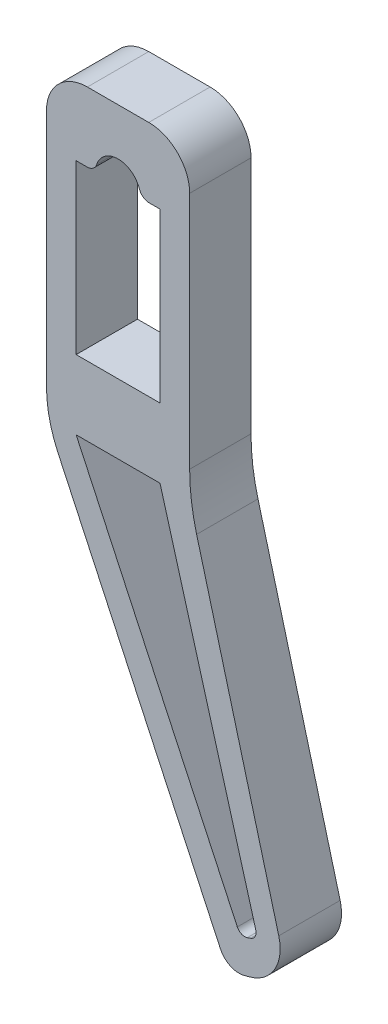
from build123d import *

# Parameters (mm, degrees)
SKETCH4_W           = 35
SKETCH4_H           = 75
BOSS_EXTRUDE2_DEPTH = 15
BOSS_EXTRUDE3_DEPTH = 15
SKETCH7_W           = 20.5
SKETCH7_H           = 41.05
CUT_EXTRUDE2_DEPTH  = 140.766205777
CUT_EXTRUDE4_DEPTH  = 140.766205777
CUT_EXTRUDE5_DEPTH  = 140.766205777
CUT_EXTRUDE6_DEPTH  = 140.766205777
FILLET1_R           = 10
FILLET2_R           = 5
FILLET3_R           = 30
FILLET4_R           = 50
FILLET6_R           = 2
FILLET5_R           = 10
FILLET7_R           = 2.5


with BuildPart() as part:
    # Sketch4 → Boss-Extrude2 (new body)
    with BuildSketch(Plane.XY):
        Rectangle(SKETCH4_W, SKETCH4_H)
    extrude(amount=BOSS_EXTRUDE2_DEPTH)

    # Sketch5 → Boss-Extrude3 (add)
    with BuildSketch(Plane.XY.offset(15)):
        Polygon((-17.5, -37.5), (26.799227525, -132.5), (41.872930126, -128.461013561), (17.5, -37.5), align=None)
    extrude(amount=-BOSS_EXTRUDE3_DEPTH)

    # Sketch7 → Cut-Extrude2 (cut, through all)
    with BuildSketch(Plane.XY.offset(15)):
        Rectangle(SKETCH7_W, SKETCH7_H)
    extrude(amount=-CUT_EXTRUDE2_DEPTH, mode=Mode.SUBTRACT)

    # Sketch11 → Cut-Extrude4 (cut, through all)
    with BuildSketch(Plane.XY.offset(15)):
        with BuildLine():
            Line((-5.5, 20.525), (5.5, 20.525))
            ThreePointArc((5.5, 20.525), (0, 26.025), (-5.5, 20.525))
        make_face()
    extrude(amount=-CUT_EXTRUDE4_DEPTH, mode=Mode.SUBTRACT)

    # Sketch14 → Cut-Extrude5 (cut, through all)
    with BuildSketch(Plane.XY.offset(15)):
        Polygon((-10.25, -37.5), (10.25, -37.5), (29.898734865, -123.599239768), align=None)
    extrude(amount=-CUT_EXTRUDE5_DEPTH, mode=Mode.SUBTRACT)

    # Sketch15 → Cut-Extrude6 (cut, through all)
    with BuildSketch(Plane.XY.offset(15)):
        Polygon((10.25, -37.5), (34.17117389, -122.186347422), (29.898734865, -123.599239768), align=None)
    extrude(amount=-CUT_EXTRUDE6_DEPTH, mode=Mode.SUBTRACT)

    # Fillet1
    fillet1_edges = [part.edges().sort_by_distance(p)[0] for p in [
        (41.872930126, -128.461013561, 7.5),
    ]]
    fillet(fillet1_edges, radius=FILLET1_R)

    # Fillet2
    fillet2_edges = [part.edges().sort_by_distance(p)[0] for p in [
        (26.799227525, -132.5, 7.5),
    ]]
    fillet(fillet2_edges, radius=FILLET2_R)

    # Fillet3
    fillet3_edges = [part.edges().sort_by_distance(p)[0] for p in [
        (-17.5, -37.5, 7.5),
    ]]
    fillet(fillet3_edges, radius=FILLET3_R)

    # Fillet4
    fillet4_edges = [part.edges().sort_by_distance(p)[0] for p in [
        (17.5, -37.5, 7.5),
    ]]
    fillet(fillet4_edges, radius=FILLET4_R)

    # Fillet6
    fillet6_edges = [part.edges().sort_by_distance(p)[0] for p in [
        (29.898734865, -123.599239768, 7.5),
        (34.17117389, -122.186347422, 7.5),
    ]]
    fillet(fillet6_edges, radius=FILLET6_R)

    # Fillet5
    fillet5_edges = [part.edges().sort_by_distance(p)[0] for p in [
        (-17.5, 37.5, 7.5),
        (17.5, 37.5, 7.5),
    ]]
    fillet(fillet5_edges, radius=FILLET5_R)

    # Fillet7
    fillet7_edges = [part.edges().sort_by_distance(p)[0] for p in [
        (-5.5, 20.525, 7.5),
        (5.5, 20.525, 7.5),
    ]]
    fillet(fillet7_edges, radius=FILLET7_R)


solid = part.part
